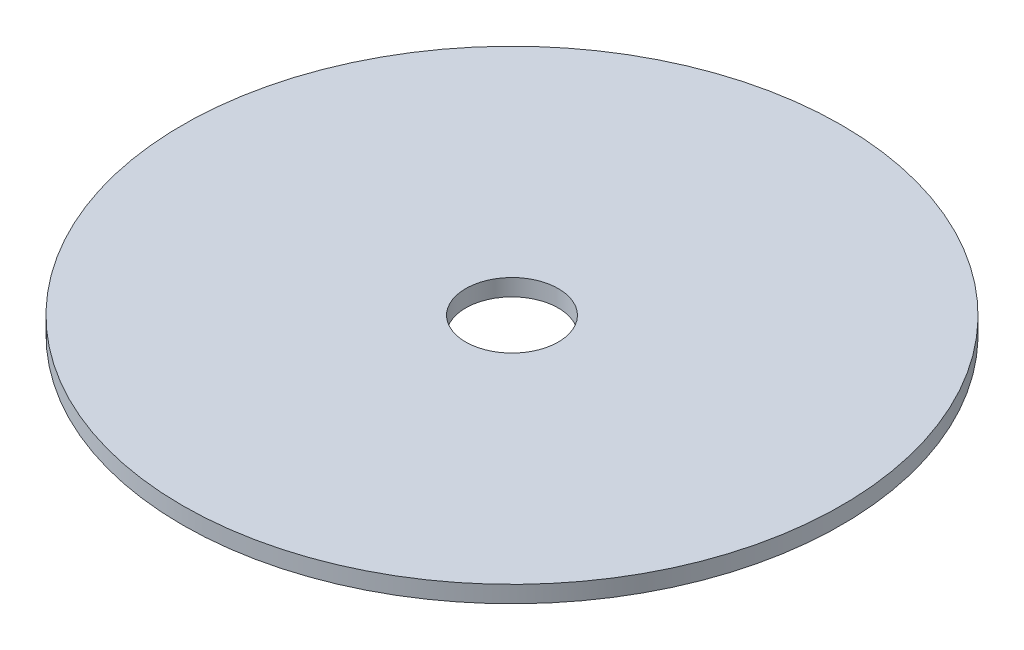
from build123d import *

# Parameters (mm, degrees)
SKETCH1_R           = 25.4
SKETCH1_R_2         = 3.5687
BOSS_EXTRUDE1_DEPTH = 1.2954


with BuildPart() as part:
    # Sketch1 → Boss-Extrude1 (new body)
    with BuildSketch(Plane(origin=(0, 0, 0), x_dir=(1, 0, 0), z_dir=(0, 1, 0))):
        with Locations(Location((0, 0, 0), (0, 0, 270))):
            Circle(SKETCH1_R)
        with Locations(Location((0, 0, 0), (0, 0, 270))):
            Circle(SKETCH1_R_2, mode=Mode.SUBTRACT)
    extrude(amount=BOSS_EXTRUDE1_DEPTH)


solid = part.part
